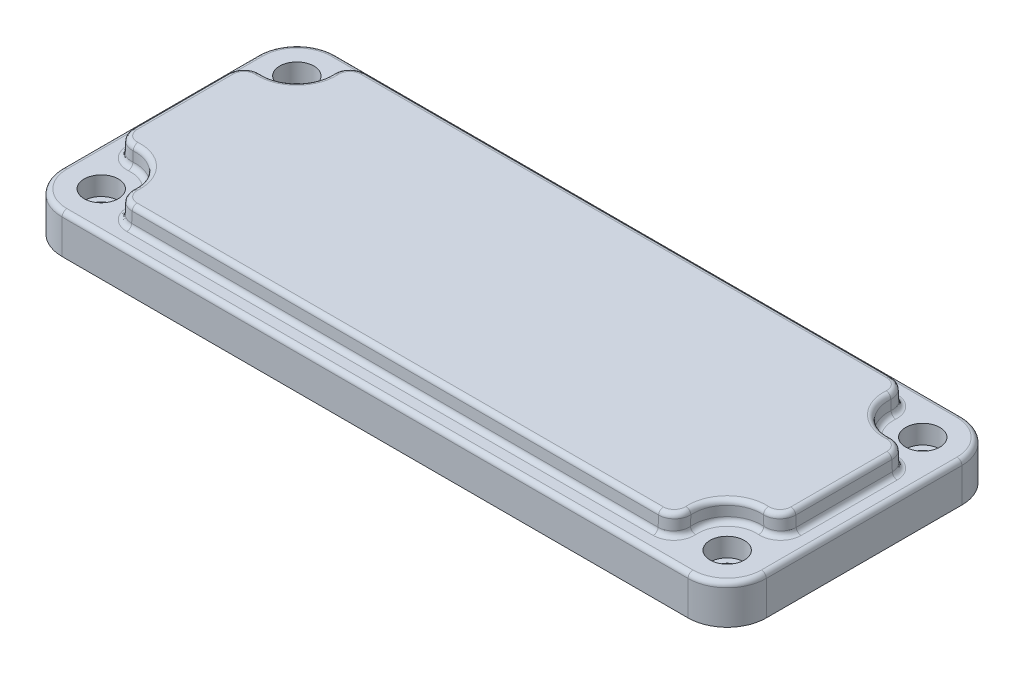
from build123d import *

# Parameters (mm, degrees)
BASE_EXTRUDE_DEPTH                                  = 6.35
BOSS_EXTRUDE1_DEPTH                                 = 3.175
BOSS_EXTRUDE1_TAPER                                 = 2.999999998
CUT_EXTRUDE1_START                                  = -3.175
SKETCH3_R                                           = 5.55625
CUT_EXTRUDE1_DEPTH                                  = 3.175
MIRROR2_START                                       = -3.175
MIRROR2_COPY_1_SKETCH_R                             = 5.55625
MIRROR2_COPY_1_DEPTH                                = 3.175
FILLET1_R                                           = 2.54
FILLET2_R                                           = 0.79375
SKETCH5_W                                           = 88.9
SKETCH5_H                                           = 31.75
CUT_EXTRUDE3_DEPTH                                  = 6.35
CUT_EXTRUDE3_DRAFT                                  = -2.999999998
FILLET3_R                                           = 6.35
FILLET4_R                                           = 3.175
CBORE_FOR_5_FILLISTER_HEAD_MACHINE_SCRE_D           = 3.4544
CBORE_FOR_5_FILLISTER_HEAD_MACHINE_SCRE_CBORE_D     = 5.55752
CBORE_FOR_5_FILLISTER_HEAD_MACHINE_SCRE_CBORE_DEPTH = 3.048


with BuildPart() as part:
    # Sketch1 → Base-Extrude (new body)
    with BuildSketch(Plane(origin=(0, 0, 0), x_dir=(1, 0, 0), z_dir=(0, 1, 0))):
        with BuildLine():
            Line((-50.8, 22.225), (50.8, 22.225))
            ThreePointArc((50.8, 22.225), (55.290128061, 20.365128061), (57.15, 15.875))
            Line((57.15, 15.875), (57.15, -15.875))
            ThreePointArc((57.15, -15.875), (55.290128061, -20.365128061), (50.8, -22.225))
            Line((50.8, -22.225), (-50.8, -22.225))
            ThreePointArc((-50.8, -22.225), (-55.290128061, -20.365128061), (-57.15, -15.875))
            Line((-57.15, -15.875), (-57.15, 15.875))
            ThreePointArc((-57.15, 15.875), (-55.290128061, 20.365128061), (-50.8, 22.225))
        make_face()
    extrude(amount=BASE_EXTRUDE_DEPTH)

    # Sketch2 → Boss-Extrude1 (add)
    with BuildSketch(Plane(origin=(0, 6.35, 0), x_dir=(-1, 0, 0), z_dir=(0, 1, 0))):
        with BuildLine():
            Line((50.8, 19.05), (-50.8, 19.05))
            ThreePointArc((-50.8, 19.05), (-53.04506403, 18.12006403), (-53.975, 15.875))
            Line((-53.975, 15.875), (-53.975, -15.875))
            ThreePointArc((-53.975, -15.875), (-53.04506403, -18.12006403), (-50.8, -19.05))
            Line((-50.8, -19.05), (50.8, -19.05))
            ThreePointArc((50.8, -19.05), (53.04506403, -18.12006403), (53.975, -15.875))
            Line((53.975, -15.875), (53.975, 15.875))
            ThreePointArc((53.975, 15.875), (53.04506403, 18.12006403), (50.8, 19.05))
        make_face()
    extrude(amount=BOSS_EXTRUDE1_DEPTH, taper=BOSS_EXTRUDE1_TAPER)

    # Sketch3 → Cut-Extrude1 (cut)
    with BuildSketch(Plane(origin=(0, 9.525, 0), x_dir=(-1, 0, 0), z_dir=(0, 1, 0)).offset(CUT_EXTRUDE1_START)):
        with Locations((-50.8, 15.875)):
            Circle(SKETCH3_R)
    cut_extrude1 = extrude(amount=CUT_EXTRUDE1_DEPTH, mode=Mode.SUBTRACT)

    # Mirror1: Cut-Extrude1 across plane
    add(cut_extrude1.mirror(Plane.XY), mode=Mode.SUBTRACT)

    # Mirror2: Cut-Extrude1 across plane
    add(cut_extrude1.mirror(Plane(origin=(0, 0, 0), x_dir=(0, 0, 1), z_dir=(1, 0, 0))), mode=Mode.SUBTRACT)

    # Mirror2 copy 1 sketch → Mirror2 copy 1 (cut)
    with BuildSketch(Plane(origin=(0, 9.525, 0), x_dir=(1, 0, 0), z_dir=(0, 1, 0)).offset(MIRROR2_START)):
        with Locations((-50.8, 15.875)):
            Circle(MIRROR2_COPY_1_SKETCH_R)
    extrude(amount=MIRROR2_COPY_1_DEPTH, mode=Mode.SUBTRACT)

    # Fillet1
    fillet1_edges = [part.edges().sort_by_distance(p)[0] for p in [
        (53.891804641, 7.937462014, 11.258436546),
        (46.183436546, 7.937462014, 18.966804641),
        (53.891804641, 7.937462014, -11.258436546),
        (46.183436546, 7.937462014, -18.966804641),
        (-53.891804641, 7.937462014, -11.258436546),
        (-46.183436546, 7.937462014, -18.966804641),
        (-46.183436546, 7.937462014, 18.966804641),
        (-53.891804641, 7.937462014, 11.258436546),
    ]]
    fillet(fillet1_edges, radius=FILLET1_R)

    # Fillet2
    fillet2_edges = [part.edges().sort_by_distance(p)[0] for p in [
        (55.290128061, 6.35, 20.365128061),
        (53.010366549, 9.525, -9.640444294),
        (53.010366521, 9.525, 9.640444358),
        (44.565444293, 9.525, 18.085366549),
        (46.871137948, 6.35, 11.946137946),
        (53.975, 6.35, -2.5e-08),
        (46.871137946, 6.35, -11.946137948),
        (-2.5e-08, 6.35, -19.05),
        (-46.871137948, 6.35, -11.946137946),
        (-53.975, 6.35, 2.5e-08),
        (-46.871137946, 6.35, 11.946137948),
        (44.594746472, 6.35, 18.232589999),
        (53.15759001, 6.35, 9.669746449),
        (53.157589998, 6.35, -9.669746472),
        (44.594746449, 6.35, -18.23259001),
        (-44.594746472, 6.35, -18.232589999),
        (-53.15759001, 6.35, -9.669746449),
        (-53.157589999, 6.35, 9.669746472),
        (-44.594746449, 6.35, 18.23259001),
        (57.15, 6.35, 0),
        (55.290128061, 6.35, -20.365128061),
        (0, 6.35, -22.225),
        (-55.290128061, 6.35, -20.365128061),
        (-57.15, 6.35, 0),
        (-55.290128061, 6.35, 20.365128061),
        (0, 6.35, 22.225),
        (2.5e-08, 6.35, 19.05),
        (-6.9e-08, 9.525, 18.883605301),
        (-53.808605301, 9.525, -6.9e-08),
        (-46.871137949, 9.525, 11.946137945),
        (46.871137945, 9.525, 11.946137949),
        (53.808605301, 9.525, 6.9e-08),
        (46.871137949, 9.525, -11.946137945),
        (6.9e-08, 9.525, -18.883605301),
        (-46.871137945, 9.525, -11.946137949),
        (-44.565444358, 9.525, 18.085366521),
        (-53.010366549, 9.525, 9.640444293),
        (-53.010366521, 9.525, -9.640444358),
        (-44.565444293, 9.525, -18.085366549),
        (44.565444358, 9.525, -18.085366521),
    ]]
    fillet(fillet2_edges, radius=FILLET2_R)


with BuildPart() as cut_extrude3_tool:
    # Sketch5 → Cut-Extrude3 (with draft: the straight prism first)
    with BuildSketch(Plane.XZ):
        Rectangle(SKETCH5_W, SKETCH5_H)
    extrude(amount=-CUT_EXTRUDE3_DEPTH)
    # Cut-Extrude3: the draft: its side faces are tilted about the plane it starts from
    cut_extrude3_sides = [cut_extrude3_tool.faces().sort_by_distance(p)[0] for p in [
        (-44.45, 3.175, 0),
        (0, 3.175, -15.875),
        (44.45, 3.175, 0),
        (0, 3.175, 15.875),
    ]]
    draft(cut_extrude3_sides, Plane.XZ, CUT_EXTRUDE3_DRAFT)


with BuildPart() as part_1:
    add(part.part)

    # Cut-Extrude3: cut by cut_extrude3_tool
    add(cut_extrude3_tool.part, mode=Mode.SUBTRACT)

    # Fillet3
    fillet3_edges = [part_1.edges().sort_by_distance(p)[0] for p in [
        (-44.283605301, 3.175, -15.708605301),
        (-44.283605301, 3.175, 15.708605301),
        (44.283605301, 3.175, 15.708605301),
        (44.283605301, 3.175, -15.708605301),
    ]]
    fillet(fillet3_edges, radius=FILLET3_R)

    # Fillet4
    fillet4_edges = [part_1.edges().sort_by_distance(p)[0] for p in [
        (-44.117210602, 6.35, 0),
        (0, 6.35, 15.542210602),
        (0, 6.35, -15.542210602),
        (44.117210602, 6.35, 0),
        (-42.260939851, 6.35, -13.685939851),
        (42.260939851, 6.35, 13.685939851),
        (42.260939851, 6.35, -13.685939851),
        (-42.260939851, 6.35, 13.685939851),
    ]]
    fillet(fillet4_edges, radius=FILLET4_R)

    # CBORE for _5 Fillister Head Machine Scre (through all)
    with Locations(Plane(origin=(0, 6.35, 0), x_dir=(-1, 0, 0), z_dir=(0, 1, 0))):
        with Locations((-50.8, 15.875), (-50.8, -15.875), (50.8, -15.875), (50.8, 15.875)):
            CounterBoreHole(CBORE_FOR_5_FILLISTER_HEAD_MACHINE_SCRE_D / 2, CBORE_FOR_5_FILLISTER_HEAD_MACHINE_SCRE_CBORE_D / 2, CBORE_FOR_5_FILLISTER_HEAD_MACHINE_SCRE_CBORE_DEPTH)


solid = part_1.part
